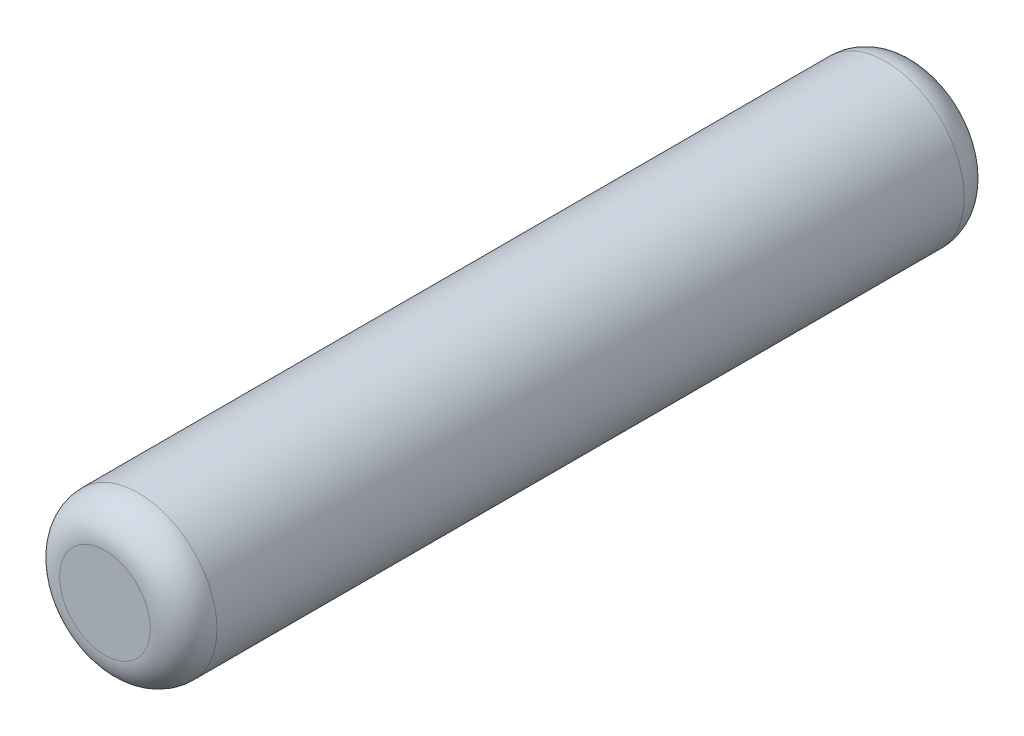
from build123d import *


with BuildPart() as part:
    # Sketch 1 → Revolve 1 (revolve)
    with BuildSketch(Plane(origin=(0, 0, 0), x_dir=(0, 0, -1), z_dir=(1, 0, 0)), mode=Mode.PRIVATE) as revolve_1_sk:
        with BuildLine():
            Line((-6.2103, 0), (6.2103, 0))
            Line((6.2103, 0), (6.2103, 0.69215))
            ThreePointArc((6.2103, 0.69215), (6.061510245, 1.051360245), (5.7023, 1.20015))
            Line((5.7023, 1.20015), (-5.7023, 1.20015))
            ThreePointArc((-5.7023, 1.20015), (-6.061510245, 1.051360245), (-6.2103, 0.69215))
            Line((-6.2103, 0.69215), (-6.2103, 0))
        make_face()
    revolve(revolve_1_sk.sketch.rotate(Axis((0, 0, 35.490991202), (0, 0, -1)), 90), axis=Axis((0, 0, 35.490991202), (0, 0, -1)))


solid = part.part
